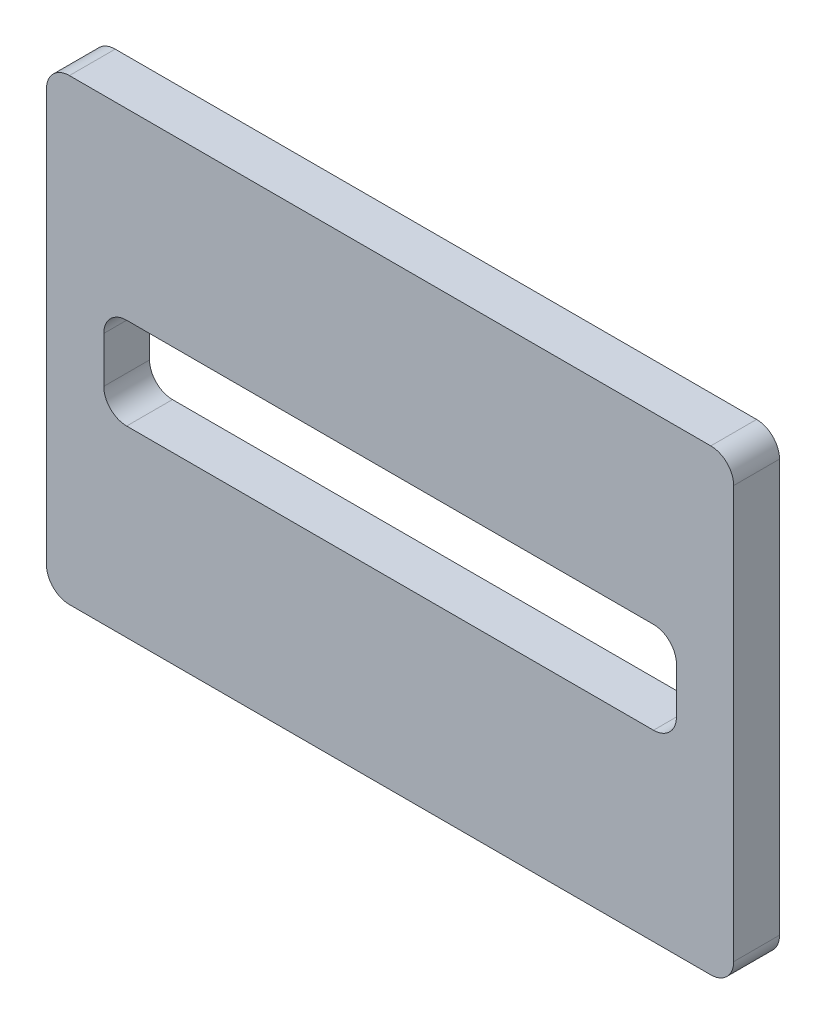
from build123d import *

# Parameters (mm, degrees)
ESQUISSE2_W             = 300
ESQUISSE2_H             = 200
BOSS_EXTRU_1_DEPTH      = 20
ESQUISSE6_W             = 250
ESQUISSE6_H             = 11
ENL_V_MAT_EXTRU_2_DEPTH = 3
CONG_1_R                = 10
ESQUISSE7_W             = 250
ESQUISSE7_H             = 40
ENL_V_MAT_EXTRU_3_DEPTH = 362.109401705
CONG_3_R                = 10


with BuildPart() as part:
    # Esquisse2 → Boss.-Extru.1 (new body)
    with BuildSketch(Plane.XY):
        with Locations((150, 100)):
            Rectangle(ESQUISSE2_W, ESQUISSE2_H)
    extrude(amount=BOSS_EXTRU_1_DEPTH)

    # Esquisse6 → Enl_v. mat.-Extru.2 (cut)
    with BuildSketch(Plane(origin=(0, 0, 0), x_dir=(-1, 0, 0), z_dir=(0, 0, -1))):
        with Locations((-150, 35.5)):
            Rectangle(ESQUISSE6_W, ESQUISSE6_H)
        with Locations((-150, 164.5)):
            Rectangle(ESQUISSE6_W, ESQUISSE6_H)
    extrude(amount=-ENL_V_MAT_EXTRU_2_DEPTH, mode=Mode.SUBTRACT)

    # Cong_1
    cong_1_edges = [part.edges().sort_by_distance(p)[0] for p in [
        (0, 200, 10),
        (300, 200, 10),
        (300, 0, 10),
        (0, 0, 10),
    ]]
    fillet(cong_1_edges, radius=CONG_1_R)

    # Esquisse7 → Enl_v. mat.-Extru.3 (cut, through all)
    with BuildSketch(Plane(origin=(0, 0, 0), x_dir=(-1, 0, 0), z_dir=(0, 0, -1))):
        with Locations((-150, 100)):
            Rectangle(ESQUISSE7_W, ESQUISSE7_H)
    extrude(amount=-ENL_V_MAT_EXTRU_3_DEPTH, mode=Mode.SUBTRACT)

    # Cong_3
    cong_3_edges = [part.edges().sort_by_distance(p)[0] for p in [
        (25, 120, 10),
        (25, 80, 10),
        (275, 80, 10),
        (275, 120, 10),
    ]]
    fillet(cong_3_edges, radius=CONG_3_R)


solid = part.part
